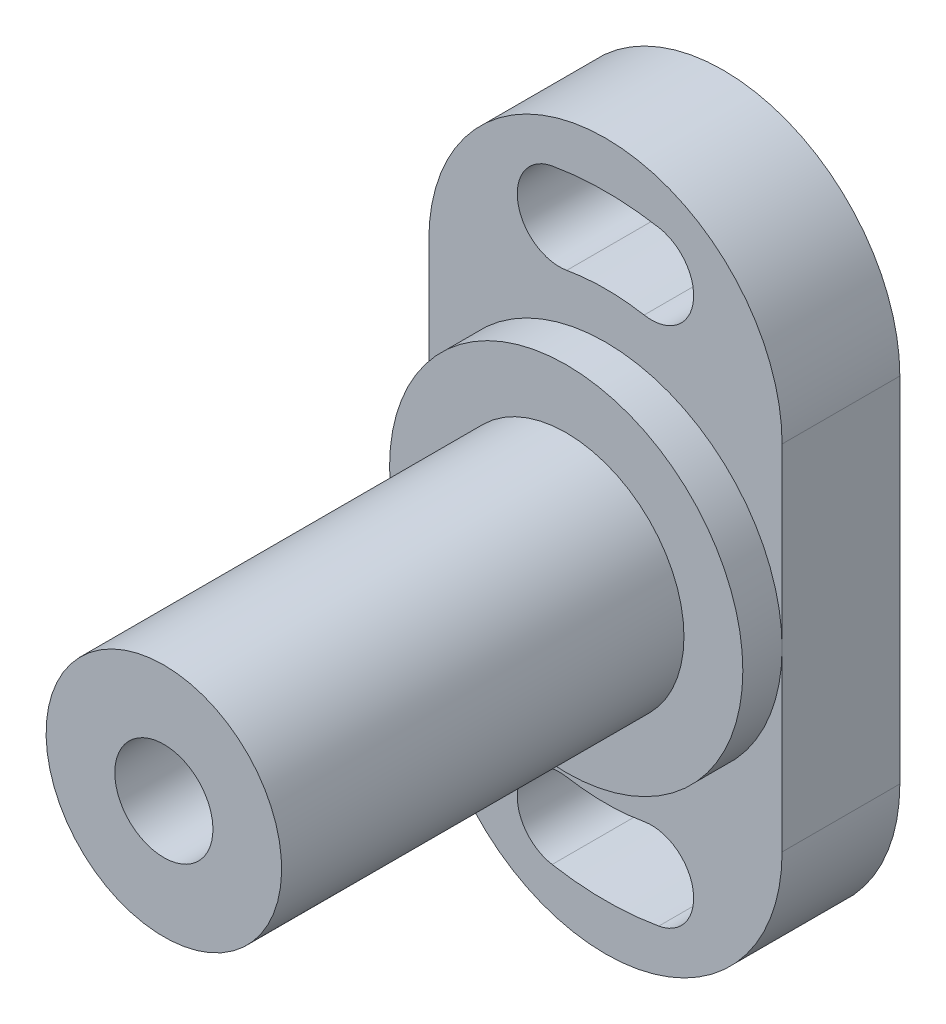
ISO-10303-21;
HEADER;
FILE_DESCRIPTION(('STEP AP214'),'2;1');
FILE_NAME('part.step','',(''),(''),'','','');
FILE_SCHEMA(('AUTOMOTIVE_DESIGN { 1 0 10303 214 1 1 1 1 }'));
ENDSEC;
DATA;
#1=APPLICATION_CONTEXT('core data for automotive mechanical design processes');
#2=APPLICATION_PROTOCOL_DEFINITION('international standard','automotive_design',2000,#1);
#3=PRODUCT_CONTEXT('',#1,'mechanical');
#4=PRODUCT('Part','Part','',(#3));
#5=PRODUCT_RELATED_PRODUCT_CATEGORY('part','',(#4));
#6=PRODUCT_DEFINITION_FORMATION('','',#4);
#7=PRODUCT_DEFINITION_CONTEXT('part definition',#1,'design');
#8=PRODUCT_DEFINITION('design','',#6,#7);
#9=PRODUCT_DEFINITION_SHAPE('','',#8);
#10=(LENGTH_UNIT() NAMED_UNIT(*) SI_UNIT(.MILLI.,.METRE.));
#11=(NAMED_UNIT(*) PLANE_ANGLE_UNIT() SI_UNIT($,.RADIAN.));
#12=(NAMED_UNIT(*) SI_UNIT($,.STERADIAN.) SOLID_ANGLE_UNIT());
#13=UNCERTAINTY_MEASURE_WITH_UNIT(LENGTH_MEASURE(1.E-05),#10,'distance_accuracy_value','');
#14=(GEOMETRIC_REPRESENTATION_CONTEXT(3) GLOBAL_UNCERTAINTY_ASSIGNED_CONTEXT((#13)) GLOBAL_UNIT_ASSIGNED_CONTEXT((#10,
#11,#12)) REPRESENTATION_CONTEXT('',''));
#15=CARTESIAN_POINT('',(0.,0.,0.));
#16=DIRECTION('',(0.,0.,1.));
#17=DIRECTION('',(1.,0.,0.));
#18=AXIS2_PLACEMENT_3D('',#15,#16,#17);
#19=CARTESIAN_POINT('',(0.,9.,6.));
#20=DIRECTION('',(0.,0.,1.));
#21=DIRECTION('',(0.,-1.,0.));
#22=AXIS2_PLACEMENT_3D('',#19,#20,#21);
#23=PLANE('',#22);
#24=CARTESIAN_POINT('',(0.,0.,6.));
#25=DIRECTION('',(0.,0.,-1.));
#26=DIRECTION('',(0.,1.,0.));
#27=AXIS2_PLACEMENT_3D('',#24,#25,#26);
#28=CIRCLE('',#27,9.);
#29=CARTESIAN_POINT('',(-9.,0.,6.));
#30=VERTEX_POINT('',#29);
#31=CARTESIAN_POINT('',(9.,0.,6.));
#32=VERTEX_POINT('',#31);
#33=EDGE_CURVE('E129',#30,#32,#28,.T.);
#34=ORIENTED_EDGE('',*,*,#33,.T.);
#35=DIRECTION('',(0.,1.,0.));
#36=VECTOR('',#35,1.);
#37=CARTESIAN_POINT('',(9.,9.,6.));
#38=LINE('',#37,#36);
#39=CARTESIAN_POINT('',(9.,9.,6.));
#40=VERTEX_POINT('',#39);
#41=EDGE_CURVE('E118',#32,#40,#38,.T.);
#42=ORIENTED_EDGE('',*,*,#41,.T.);
#43=CARTESIAN_POINT('',(0.,9.,6.));
#44=DIRECTION('',(0.,0.,1.));
#45=DIRECTION('',(0.,-1.,0.));
#46=AXIS2_PLACEMENT_3D('',#43,#44,#45);
#47=CIRCLE('',#46,9.);
#48=CARTESIAN_POINT('',(-9.,9.,6.));
#49=VERTEX_POINT('',#48);
#50=EDGE_CURVE('E213',#40,#49,#47,.T.);
#51=ORIENTED_EDGE('',*,*,#50,.T.);
#52=DIRECTION('',(0.,-1.,0.));
#53=VECTOR('',#52,1.);
#54=CARTESIAN_POINT('',(-9.,9.,6.));
#55=LINE('',#54,#53);
#56=EDGE_CURVE('E131',#49,#30,#55,.T.);
#57=ORIENTED_EDGE('',*,*,#56,.T.);
#58=EDGE_LOOP('',(#34,#42,#51,#57));
#59=FACE_BOUND('',#58,.T.);
#60=CARTESIAN_POINT('',(-2.34425039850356,13.2949046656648,6.));
#61=DIRECTION('',(0.,0.,1.));
#62=DIRECTION('',(0.,1.,0.));
#63=AXIS2_PLACEMENT_3D('',#60,#61,#62);
#64=CIRCLE('',#63,2.15);
#65=CARTESIAN_POINT('',(-2.71759398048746,15.412241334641,6.));
#66=VERTEX_POINT('',#65);
#67=CARTESIAN_POINT('',(-1.97090681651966,11.1775679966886,6.));
#68=VERTEX_POINT('',#67);
#69=EDGE_CURVE('E187',#66,#68,#64,.T.);
#70=ORIENTED_EDGE('',*,*,#69,.F.);
#71=CARTESIAN_POINT('',(0.,0.,6.));
#72=DIRECTION('',(0.,0.,1.));
#73=DIRECTION('',(0.,-1.,0.));
#74=AXIS2_PLACEMENT_3D('',#71,#72,#73);
#75=CIRCLE('',#74,15.65);
#76=CARTESIAN_POINT('',(2.71759398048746,15.412241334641,6.));
#77=VERTEX_POINT('',#76);
#78=EDGE_CURVE('E185',#77,#66,#75,.T.);
#79=ORIENTED_EDGE('',*,*,#78,.F.);
#80=CARTESIAN_POINT('',(2.34425039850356,13.2949046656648,6.));
#81=DIRECTION('',(0.,0.,1.));
#82=DIRECTION('',(0.,-1.,0.));
#83=AXIS2_PLACEMENT_3D('',#80,#81,#82);
#84=CIRCLE('',#83,2.15);
#85=CARTESIAN_POINT('',(1.97090681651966,11.1775679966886,6.));
#86=VERTEX_POINT('',#85);
#87=EDGE_CURVE('E192',#86,#77,#84,.T.);
#88=ORIENTED_EDGE('',*,*,#87,.F.);
#89=CARTESIAN_POINT('',(0.,0.,6.));
#90=DIRECTION('',(0.,0.,-1.));
#91=DIRECTION('',(0.,-1.,0.));
#92=AXIS2_PLACEMENT_3D('',#89,#90,#91);
#93=CIRCLE('',#92,11.35);
#94=EDGE_CURVE('E189',#68,#86,#93,.T.);
#95=ORIENTED_EDGE('',*,*,#94,.F.);
#96=EDGE_LOOP('',(#70,#79,#88,#95));
#97=FACE_BOUND('',#96,.T.);
#98=ADVANCED_FACE('F14',(#59,#97),#23,.T.);
#99=EDGE_CURVE('E30',#32,#30,#28,.T.);
#100=ORIENTED_EDGE('',*,*,#99,.T.);
#101=CARTESIAN_POINT('',(-9.,-9.,6.));
#102=VERTEX_POINT('',#101);
#103=EDGE_CURVE('E215',#30,#102,#55,.T.);
#104=ORIENTED_EDGE('',*,*,#103,.T.);
#105=CARTESIAN_POINT('',(0.,-9.,6.));
#106=DIRECTION('',(0.,0.,1.));
#107=DIRECTION('',(0.,1.,0.));
#108=AXIS2_PLACEMENT_3D('',#105,#106,#107);
#109=CIRCLE('',#108,9.);
#110=CARTESIAN_POINT('',(9.,-9.,6.));
#111=VERTEX_POINT('',#110);
#112=EDGE_CURVE('E113',#102,#111,#109,.T.);
#113=ORIENTED_EDGE('',*,*,#112,.T.);
#114=EDGE_CURVE('E108',#111,#32,#38,.T.);
#115=ORIENTED_EDGE('',*,*,#114,.T.);
#116=EDGE_LOOP('',(#100,#104,#113,#115));
#117=FACE_BOUND('',#116,.T.);
#118=CARTESIAN_POINT('',(0.,0.,6.));
#119=DIRECTION('',(0.,0.,-1.));
#120=DIRECTION('',(0.,1.,0.));
#121=AXIS2_PLACEMENT_3D('',#118,#119,#120);
#122=CIRCLE('',#121,11.35);
#123=CARTESIAN_POINT('',(1.97090681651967,-11.1775679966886,6.));
#124=VERTEX_POINT('',#123);
#125=CARTESIAN_POINT('',(-1.97090681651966,-11.1775679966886,6.));
#126=VERTEX_POINT('',#125);
#127=EDGE_CURVE('E158',#124,#126,#122,.T.);
#128=ORIENTED_EDGE('',*,*,#127,.F.);
#129=CARTESIAN_POINT('',(2.34425039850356,-13.2949046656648,6.));
#130=DIRECTION('',(0.,0.,1.));
#131=DIRECTION('',(0.,1.,0.));
#132=AXIS2_PLACEMENT_3D('',#129,#130,#131);
#133=CIRCLE('',#132,2.15);
#134=CARTESIAN_POINT('',(2.71759398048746,-15.412241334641,6.));
#135=VERTEX_POINT('',#134);
#136=EDGE_CURVE('E156',#135,#124,#133,.T.);
#137=ORIENTED_EDGE('',*,*,#136,.F.);
#138=CARTESIAN_POINT('',(0.,0.,6.));
#139=DIRECTION('',(0.,0.,1.));
#140=DIRECTION('',(0.,1.,0.));
#141=AXIS2_PLACEMENT_3D('',#138,#139,#140);
#142=CIRCLE('',#141,15.65);
#143=CARTESIAN_POINT('',(-2.71759398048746,-15.412241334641,6.));
#144=VERTEX_POINT('',#143);
#145=EDGE_CURVE('E162',#144,#135,#142,.T.);
#146=ORIENTED_EDGE('',*,*,#145,.F.);
#147=CARTESIAN_POINT('',(-2.34425039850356,-13.2949046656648,6.));
#148=DIRECTION('',(0.,0.,1.));
#149=DIRECTION('',(0.,-1.,0.));
#150=AXIS2_PLACEMENT_3D('',#147,#148,#149);
#151=CIRCLE('',#150,2.15);
#152=EDGE_CURVE('E160',#126,#144,#151,.T.);
#153=ORIENTED_EDGE('',*,*,#152,.F.);
#154=EDGE_LOOP('',(#128,#137,#146,#153));
#155=FACE_BOUND('',#154,.T.);
#156=ADVANCED_FACE('F110',(#117,#155),#23,.T.);
#157=CARTESIAN_POINT('',(0.,9.,0.));
#158=DIRECTION('',(0.,0.,1.));
#159=DIRECTION('',(0.,-1.,0.));
#160=AXIS2_PLACEMENT_3D('',#157,#158,#159);
#161=PLANE('',#160);
#162=CARTESIAN_POINT('',(0.,0.,0.));
#163=DIRECTION('',(0.,0.,1.));
#164=DIRECTION('',(0.,-1.,0.));
#165=AXIS2_PLACEMENT_3D('',#162,#163,#164);
#166=CIRCLE('',#165,15.65);
#167=CARTESIAN_POINT('',(2.71759398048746,15.412241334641,0.));
#168=VERTEX_POINT('',#167);
#169=CARTESIAN_POINT('',(-2.71759398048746,15.412241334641,0.));
#170=VERTEX_POINT('',#169);
#171=EDGE_CURVE('E173',#168,#170,#166,.T.);
#172=ORIENTED_EDGE('',*,*,#171,.T.);
#173=CARTESIAN_POINT('',(-2.34425039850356,13.2949046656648,0.));
#174=DIRECTION('',(0.,0.,1.));
#175=DIRECTION('',(0.,1.,0.));
#176=AXIS2_PLACEMENT_3D('',#173,#174,#175);
#177=CIRCLE('',#176,2.15);
#178=CARTESIAN_POINT('',(-1.97090681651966,11.1775679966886,0.));
#179=VERTEX_POINT('',#178);
#180=EDGE_CURVE('E176',#170,#179,#177,.T.);
#181=ORIENTED_EDGE('',*,*,#180,.T.);
#182=CARTESIAN_POINT('',(0.,0.,0.));
#183=DIRECTION('',(0.,0.,-1.));
#184=DIRECTION('',(0.,-1.,0.));
#185=AXIS2_PLACEMENT_3D('',#182,#183,#184);
#186=CIRCLE('',#185,11.35);
#187=CARTESIAN_POINT('',(1.97090681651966,11.1775679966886,0.));
#188=VERTEX_POINT('',#187);
#189=EDGE_CURVE('E179',#179,#188,#186,.T.);
#190=ORIENTED_EDGE('',*,*,#189,.T.);
#191=CARTESIAN_POINT('',(2.34425039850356,13.2949046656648,0.));
#192=DIRECTION('',(0.,0.,1.));
#193=DIRECTION('',(0.,-1.,0.));
#194=AXIS2_PLACEMENT_3D('',#191,#192,#193);
#195=CIRCLE('',#194,2.15);
#196=EDGE_CURVE('E182',#188,#168,#195,.T.);
#197=ORIENTED_EDGE('',*,*,#196,.T.);
#198=EDGE_LOOP('',(#172,#181,#190,#197));
#199=FACE_BOUND('',#198,.T.);
#200=CARTESIAN_POINT('',(0.,9.,0.));
#201=DIRECTION('',(0.,0.,1.));
#202=DIRECTION('',(0.,-1.,0.));
#203=AXIS2_PLACEMENT_3D('',#200,#201,#202);
#204=CIRCLE('',#203,9.);
#205=CARTESIAN_POINT('',(9.,9.,0.));
#206=VERTEX_POINT('',#205);
#207=CARTESIAN_POINT('',(-9.,9.,0.));
#208=VERTEX_POINT('',#207);
#209=EDGE_CURVE('E204',#206,#208,#204,.T.);
#210=ORIENTED_EDGE('',*,*,#209,.F.);
#211=DIRECTION('',(0.,1.,0.));
#212=VECTOR('',#211,1.);
#213=CARTESIAN_POINT('',(9.,9.,0.));
#214=LINE('',#213,#212);
#215=CARTESIAN_POINT('',(9.,-9.,0.));
#216=VERTEX_POINT('',#215);
#217=EDGE_CURVE('E211',#216,#206,#214,.T.);
#218=ORIENTED_EDGE('',*,*,#217,.F.);
#219=CARTESIAN_POINT('',(0.,-9.,0.));
#220=DIRECTION('',(0.,0.,1.));
#221=DIRECTION('',(0.,1.,0.));
#222=AXIS2_PLACEMENT_3D('',#219,#220,#221);
#223=CIRCLE('',#222,9.);
#224=CARTESIAN_POINT('',(-9.,-9.,0.));
#225=VERTEX_POINT('',#224);
#226=EDGE_CURVE('E209',#225,#216,#223,.T.);
#227=ORIENTED_EDGE('',*,*,#226,.F.);
#228=DIRECTION('',(0.,-1.,0.));
#229=VECTOR('',#228,1.);
#230=CARTESIAN_POINT('',(-9.,9.,0.));
#231=LINE('',#230,#229);
#232=EDGE_CURVE('E207',#208,#225,#231,.T.);
#233=ORIENTED_EDGE('',*,*,#232,.F.);
#234=EDGE_LOOP('',(#210,#218,#227,#233));
#235=FACE_BOUND('',#234,.T.);
#236=CARTESIAN_POINT('',(2.34425039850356,-13.2949046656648,0.));
#237=DIRECTION('',(0.,0.,1.));
#238=DIRECTION('',(0.,1.,0.));
#239=AXIS2_PLACEMENT_3D('',#236,#237,#238);
#240=CIRCLE('',#239,2.15);
#241=CARTESIAN_POINT('',(2.71759398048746,-15.412241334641,0.));
#242=VERTEX_POINT('',#241);
#243=CARTESIAN_POINT('',(1.97090681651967,-11.1775679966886,0.));
#244=VERTEX_POINT('',#243);
#245=EDGE_CURVE('E144',#242,#244,#240,.T.);
#246=ORIENTED_EDGE('',*,*,#245,.T.);
#247=CARTESIAN_POINT('',(0.,0.,0.));
#248=DIRECTION('',(0.,0.,-1.));
#249=DIRECTION('',(0.,1.,0.));
#250=AXIS2_PLACEMENT_3D('',#247,#248,#249);
#251=CIRCLE('',#250,11.35);
#252=CARTESIAN_POINT('',(-1.97090681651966,-11.1775679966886,0.));
#253=VERTEX_POINT('',#252);
#254=EDGE_CURVE('E147',#244,#253,#251,.T.);
#255=ORIENTED_EDGE('',*,*,#254,.T.);
#256=CARTESIAN_POINT('',(-2.34425039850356,-13.2949046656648,0.));
#257=DIRECTION('',(0.,0.,1.));
#258=DIRECTION('',(0.,-1.,0.));
#259=AXIS2_PLACEMENT_3D('',#256,#257,#258);
#260=CIRCLE('',#259,2.15);
#261=CARTESIAN_POINT('',(-2.71759398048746,-15.412241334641,0.));
#262=VERTEX_POINT('',#261);
#263=EDGE_CURVE('E150',#253,#262,#260,.T.);
#264=ORIENTED_EDGE('',*,*,#263,.T.);
#265=CARTESIAN_POINT('',(0.,0.,0.));
#266=DIRECTION('',(0.,0.,1.));
#267=DIRECTION('',(0.,1.,0.));
#268=AXIS2_PLACEMENT_3D('',#265,#266,#267);
#269=CIRCLE('',#268,15.65);
#270=EDGE_CURVE('E153',#262,#242,#269,.T.);
#271=ORIENTED_EDGE('',*,*,#270,.T.);
#272=EDGE_LOOP('',(#246,#255,#264,#271));
#273=FACE_BOUND('',#272,.T.);
#274=ADVANCED_FACE('F233',(#199,#235,#273),#161,.F.);
#275=CARTESIAN_POINT('',(0.,9.,6.));
#276=DIRECTION('',(0.,0.,-1.));
#277=DIRECTION('',(0.,1.,0.));
#278=AXIS2_PLACEMENT_3D('',#275,#276,#277);
#279=CYLINDRICAL_SURFACE('',#278,9.);
#280=ORIENTED_EDGE('',*,*,#209,.T.);
#281=DIRECTION('',(0.,0.,-1.));
#282=VECTOR('',#281,1.);
#283=CARTESIAN_POINT('',(-9.,9.,6.));
#284=LINE('',#283,#282);
#285=EDGE_CURVE('E23',#49,#208,#284,.T.);
#286=ORIENTED_EDGE('',*,*,#285,.F.);
#287=ORIENTED_EDGE('',*,*,#50,.F.);
#288=DIRECTION('',(0.,0.,-1.));
#289=VECTOR('',#288,1.);
#290=CARTESIAN_POINT('',(9.,9.,6.));
#291=LINE('',#290,#289);
#292=EDGE_CURVE('E117',#40,#206,#291,.T.);
#293=ORIENTED_EDGE('',*,*,#292,.T.);
#294=EDGE_LOOP('',(#280,#286,#287,#293));
#295=FACE_BOUND('',#294,.T.);
#296=ADVANCED_FACE('F16',(#295),#279,.T.);
#297=CARTESIAN_POINT('',(-9.,9.,6.));
#298=DIRECTION('',(1.,0.,0.));
#299=DIRECTION('',(0.,1.,0.));
#300=AXIS2_PLACEMENT_3D('',#297,#298,#299);
#301=PLANE('',#300);
#302=ORIENTED_EDGE('',*,*,#232,.T.);
#303=DIRECTION('',(0.,0.,-1.));
#304=VECTOR('',#303,1.);
#305=CARTESIAN_POINT('',(-9.,-9.,6.));
#306=LINE('',#305,#304);
#307=EDGE_CURVE('E221',#102,#225,#306,.T.);
#308=ORIENTED_EDGE('',*,*,#307,.F.);
#309=ORIENTED_EDGE('',*,*,#103,.F.);
#310=ORIENTED_EDGE('',*,*,#56,.F.);
#311=ORIENTED_EDGE('',*,*,#285,.T.);
#312=EDGE_LOOP('',(#302,#308,#309,#310,#311));
#313=FACE_BOUND('',#312,.T.);
#314=ADVANCED_FACE('F227',(#313),#301,.F.);
#315=CARTESIAN_POINT('',(0.,-9.,6.));
#316=DIRECTION('',(0.,0.,-1.));
#317=DIRECTION('',(0.,1.,0.));
#318=AXIS2_PLACEMENT_3D('',#315,#316,#317);
#319=CYLINDRICAL_SURFACE('',#318,9.);
#320=ORIENTED_EDGE('',*,*,#226,.T.);
#321=DIRECTION('',(0.,0.,-1.));
#322=VECTOR('',#321,1.);
#323=CARTESIAN_POINT('',(9.,-9.,6.));
#324=LINE('',#323,#322);
#325=EDGE_CURVE('E219',#111,#216,#324,.T.);
#326=ORIENTED_EDGE('',*,*,#325,.F.);
#327=ORIENTED_EDGE('',*,*,#112,.F.);
#328=ORIENTED_EDGE('',*,*,#307,.T.);
#329=EDGE_LOOP('',(#320,#326,#327,#328));
#330=FACE_BOUND('',#329,.T.);
#331=ADVANCED_FACE('F237',(#330),#319,.T.);
#332=CARTESIAN_POINT('',(9.,9.,6.));
#333=DIRECTION('',(-1.,0.,0.));
#334=DIRECTION('',(0.,-1.,0.));
#335=AXIS2_PLACEMENT_3D('',#332,#333,#334);
#336=PLANE('',#335);
#337=ORIENTED_EDGE('',*,*,#217,.T.);
#338=ORIENTED_EDGE('',*,*,#292,.F.);
#339=ORIENTED_EDGE('',*,*,#41,.F.);
#340=ORIENTED_EDGE('',*,*,#114,.F.);
#341=ORIENTED_EDGE('',*,*,#325,.T.);
#342=EDGE_LOOP('',(#337,#338,#339,#340,#341));
#343=FACE_BOUND('',#342,.T.);
#344=ADVANCED_FACE('F122',(#343),#336,.F.);
#345=CARTESIAN_POINT('',(0.,0.,6.));
#346=DIRECTION('',(0.,0.,-1.));
#347=DIRECTION('',(0.,1.,0.));
#348=AXIS2_PLACEMENT_3D('',#345,#346,#347);
#349=CYLINDRICAL_SURFACE('',#348,15.65);
#350=ORIENTED_EDGE('',*,*,#171,.F.);
#351=DIRECTION('',(0.,0.,-1.));
#352=VECTOR('',#351,1.);
#353=CARTESIAN_POINT('',(2.71759398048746,15.412241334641,6.));
#354=LINE('',#353,#352);
#355=EDGE_CURVE('E194',#77,#168,#354,.T.);
#356=ORIENTED_EDGE('',*,*,#355,.F.);
#357=ORIENTED_EDGE('',*,*,#78,.T.);
#358=DIRECTION('',(0.,0.,-1.));
#359=VECTOR('',#358,1.);
#360=CARTESIAN_POINT('',(-2.71759398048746,15.412241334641,6.));
#361=LINE('',#360,#359);
#362=EDGE_CURVE('E201',#66,#170,#361,.T.);
#363=ORIENTED_EDGE('',*,*,#362,.T.);
#364=EDGE_LOOP('',(#350,#356,#357,#363));
#365=FACE_BOUND('',#364,.T.);
#366=ADVANCED_FACE('F245',(#365),#349,.F.);
#367=CARTESIAN_POINT('',(-2.34425039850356,13.2949046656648,6.));
#368=DIRECTION('',(0.,0.,-1.));
#369=DIRECTION('',(0.,1.,0.));
#370=AXIS2_PLACEMENT_3D('',#367,#368,#369);
#371=CYLINDRICAL_SURFACE('',#370,2.15);
#372=ORIENTED_EDGE('',*,*,#180,.F.);
#373=ORIENTED_EDGE('',*,*,#362,.F.);
#374=ORIENTED_EDGE('',*,*,#69,.T.);
#375=DIRECTION('',(0.,0.,-1.));
#376=VECTOR('',#375,1.);
#377=CARTESIAN_POINT('',(-1.97090681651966,11.1775679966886,6.));
#378=LINE('',#377,#376);
#379=EDGE_CURVE('E199',#68,#179,#378,.T.);
#380=ORIENTED_EDGE('',*,*,#379,.T.);
#381=EDGE_LOOP('',(#372,#373,#374,#380));
#382=FACE_BOUND('',#381,.T.);
#383=ADVANCED_FACE('F258',(#382),#371,.F.);
#384=CARTESIAN_POINT('',(0.,0.,6.));
#385=DIRECTION('',(0.,0.,-1.));
#386=DIRECTION('',(0.,1.,0.));
#387=AXIS2_PLACEMENT_3D('',#384,#385,#386);
#388=CYLINDRICAL_SURFACE('',#387,11.35);
#389=ORIENTED_EDGE('',*,*,#189,.F.);
#390=ORIENTED_EDGE('',*,*,#379,.F.);
#391=ORIENTED_EDGE('',*,*,#94,.T.);
#392=DIRECTION('',(0.,0.,-1.));
#393=VECTOR('',#392,1.);
#394=CARTESIAN_POINT('',(1.97090681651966,11.1775679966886,6.));
#395=LINE('',#394,#393);
#396=EDGE_CURVE('E197',#86,#188,#395,.T.);
#397=ORIENTED_EDGE('',*,*,#396,.T.);
#398=EDGE_LOOP('',(#389,#390,#391,#397));
#399=FACE_BOUND('',#398,.T.);
#400=ADVANCED_FACE('F262',(#399),#388,.T.);
#401=CARTESIAN_POINT('',(2.34425039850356,13.2949046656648,6.));
#402=DIRECTION('',(0.,0.,-1.));
#403=DIRECTION('',(0.,1.,0.));
#404=AXIS2_PLACEMENT_3D('',#401,#402,#403);
#405=CYLINDRICAL_SURFACE('',#404,2.15);
#406=ORIENTED_EDGE('',*,*,#196,.F.);
#407=ORIENTED_EDGE('',*,*,#396,.F.);
#408=ORIENTED_EDGE('',*,*,#87,.T.);
#409=ORIENTED_EDGE('',*,*,#355,.T.);
#410=EDGE_LOOP('',(#406,#407,#408,#409));
#411=FACE_BOUND('',#410,.T.);
#412=ADVANCED_FACE('F266',(#411),#405,.F.);
#413=CARTESIAN_POINT('',(2.34425039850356,-13.2949046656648,6.));
#414=DIRECTION('',(0.,0.,-1.));
#415=DIRECTION('',(0.,1.,0.));
#416=AXIS2_PLACEMENT_3D('',#413,#414,#415);
#417=CYLINDRICAL_SURFACE('',#416,2.15);
#418=ORIENTED_EDGE('',*,*,#245,.F.);
#419=DIRECTION('',(0.,0.,-1.));
#420=VECTOR('',#419,1.);
#421=CARTESIAN_POINT('',(2.71759398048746,-15.412241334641,6.));
#422=LINE('',#421,#420);
#423=EDGE_CURVE('E164',#135,#242,#422,.T.);
#424=ORIENTED_EDGE('',*,*,#423,.F.);
#425=ORIENTED_EDGE('',*,*,#136,.T.);
#426=DIRECTION('',(0.,0.,-1.));
#427=VECTOR('',#426,1.);
#428=CARTESIAN_POINT('',(1.97090681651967,-11.1775679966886,6.));
#429=LINE('',#428,#427);
#430=EDGE_CURVE('E170',#124,#244,#429,.T.);
#431=ORIENTED_EDGE('',*,*,#430,.T.);
#432=EDGE_LOOP('',(#418,#424,#425,#431));
#433=FACE_BOUND('',#432,.T.);
#434=ADVANCED_FACE('F270',(#433),#417,.F.);
#435=CARTESIAN_POINT('',(0.,0.,6.));
#436=DIRECTION('',(0.,0.,-1.));
#437=DIRECTION('',(0.,1.,0.));
#438=AXIS2_PLACEMENT_3D('',#435,#436,#437);
#439=CYLINDRICAL_SURFACE('',#438,11.35);
#440=ORIENTED_EDGE('',*,*,#254,.F.);
#441=ORIENTED_EDGE('',*,*,#430,.F.);
#442=ORIENTED_EDGE('',*,*,#127,.T.);
#443=DIRECTION('',(0.,0.,-1.));
#444=VECTOR('',#443,1.);
#445=CARTESIAN_POINT('',(-1.97090681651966,-11.1775679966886,6.));
#446=LINE('',#445,#444);
#447=EDGE_CURVE('E168',#126,#253,#446,.T.);
#448=ORIENTED_EDGE('',*,*,#447,.T.);
#449=EDGE_LOOP('',(#440,#441,#442,#448));
#450=FACE_BOUND('',#449,.T.);
#451=ADVANCED_FACE('F274',(#450),#439,.T.);
#452=CARTESIAN_POINT('',(-2.34425039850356,-13.2949046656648,6.));
#453=DIRECTION('',(0.,0.,-1.));
#454=DIRECTION('',(0.,1.,0.));
#455=AXIS2_PLACEMENT_3D('',#452,#453,#454);
#456=CYLINDRICAL_SURFACE('',#455,2.15);
#457=ORIENTED_EDGE('',*,*,#263,.F.);
#458=ORIENTED_EDGE('',*,*,#447,.F.);
#459=ORIENTED_EDGE('',*,*,#152,.T.);
#460=DIRECTION('',(0.,0.,-1.));
#461=VECTOR('',#460,1.);
#462=CARTESIAN_POINT('',(-2.71759398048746,-15.412241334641,6.));
#463=LINE('',#462,#461);
#464=EDGE_CURVE('E38',#144,#262,#463,.T.);
#465=ORIENTED_EDGE('',*,*,#464,.T.);
#466=EDGE_LOOP('',(#457,#458,#459,#465));
#467=FACE_BOUND('',#466,.T.);
#468=ADVANCED_FACE('F278',(#467),#456,.F.);
#469=CARTESIAN_POINT('',(0.,0.,6.));
#470=DIRECTION('',(0.,0.,-1.));
#471=DIRECTION('',(0.,1.,0.));
#472=AXIS2_PLACEMENT_3D('',#469,#470,#471);
#473=CYLINDRICAL_SURFACE('',#472,15.65);
#474=ORIENTED_EDGE('',*,*,#270,.F.);
#475=ORIENTED_EDGE('',*,*,#464,.F.);
#476=ORIENTED_EDGE('',*,*,#145,.T.);
#477=ORIENTED_EDGE('',*,*,#423,.T.);
#478=EDGE_LOOP('',(#474,#475,#476,#477));
#479=FACE_BOUND('',#478,.T.);
#480=ADVANCED_FACE('F282',(#479),#473,.F.);
#481=CARTESIAN_POINT('',(6.,0.,8.));
#482=DIRECTION('',(0.,0.,1.));
#483=DIRECTION('',(0.,-1.,0.));
#484=AXIS2_PLACEMENT_3D('',#481,#482,#483);
#485=PLANE('',#484);
#486=CARTESIAN_POINT('',(0.,0.,8.));
#487=DIRECTION('',(0.,0.,1.));
#488=DIRECTION('',(0.,-1.,0.));
#489=AXIS2_PLACEMENT_3D('',#486,#487,#488);
#490=CIRCLE('',#489,6.);
#491=CARTESIAN_POINT('',(0.,-6.,8.));
#492=VERTEX_POINT('',#491);
#493=EDGE_CURVE('E9',#492,#492,#490,.F.);
#494=ORIENTED_EDGE('',*,*,#493,.T.);
#495=EDGE_LOOP('',(#494));
#496=FACE_BOUND('',#495,.T.);
#497=CARTESIAN_POINT('',(0.,0.,8.));
#498=DIRECTION('',(0.,0.,-1.));
#499=DIRECTION('',(0.,1.,0.));
#500=AXIS2_PLACEMENT_3D('',#497,#498,#499);
#501=CIRCLE('',#500,9.);
#502=CARTESIAN_POINT('',(0.,9.,8.));
#503=VERTEX_POINT('',#502);
#504=EDGE_CURVE('E135',#503,#503,#501,.T.);
#505=ORIENTED_EDGE('',*,*,#504,.F.);
#506=EDGE_LOOP('',(#505));
#507=FACE_BOUND('',#506,.T.);
#508=ADVANCED_FACE('F286',(#496,#507),#485,.T.);
#509=CARTESIAN_POINT('',(0.,0.,0.));
#510=DIRECTION('',(0.,0.,-1.));
#511=DIRECTION('',(0.,1.,0.));
#512=AXIS2_PLACEMENT_3D('',#509,#510,#511);
#513=CYLINDRICAL_SURFACE('',#512,9.);
#514=ORIENTED_EDGE('',*,*,#504,.T.);
#515=EDGE_LOOP('',(#514));
#516=FACE_BOUND('',#515,.T.);
#517=ORIENTED_EDGE('',*,*,#99,.F.);
#518=ORIENTED_EDGE('',*,*,#33,.F.);
#519=EDGE_LOOP('',(#517,#518));
#520=FACE_BOUND('',#519,.T.);
#521=ADVANCED_FACE('F134',(#516,#520),#513,.T.);
#522=CARTESIAN_POINT('',(6.,0.,28.5));
#523=DIRECTION('',(0.,0.,1.));
#524=DIRECTION('',(0.,-1.,0.));
#525=AXIS2_PLACEMENT_3D('',#522,#523,#524);
#526=PLANE('',#525);
#527=CARTESIAN_POINT('',(0.,0.,28.5));
#528=DIRECTION('',(0.,0.,1.));
#529=DIRECTION('',(0.,-1.,0.));
#530=AXIS2_PLACEMENT_3D('',#527,#528,#529);
#531=CIRCLE('',#530,2.5);
#532=CARTESIAN_POINT('',(0.,-2.5,28.5));
#533=VERTEX_POINT('',#532);
#534=EDGE_CURVE('E18',#533,#533,#531,.T.);
#535=ORIENTED_EDGE('',*,*,#534,.F.);
#536=EDGE_LOOP('',(#535));
#537=FACE_BOUND('',#536,.T.);
#538=CARTESIAN_POINT('',(0.,0.,28.5));
#539=DIRECTION('',(0.,0.,-1.));
#540=DIRECTION('',(0.,1.,0.));
#541=AXIS2_PLACEMENT_3D('',#538,#539,#540);
#542=CIRCLE('',#541,6.);
#543=CARTESIAN_POINT('',(0.,6.,28.5));
#544=VERTEX_POINT('',#543);
#545=EDGE_CURVE('E137',#544,#544,#542,.T.);
#546=ORIENTED_EDGE('',*,*,#545,.F.);
#547=EDGE_LOOP('',(#546));
#548=FACE_BOUND('',#547,.T.);
#549=ADVANCED_FACE('F287',(#537,#548),#526,.T.);
#550=CARTESIAN_POINT('',(0.,0.,0.));
#551=DIRECTION('',(0.,0.,-1.));
#552=DIRECTION('',(0.,1.,0.));
#553=AXIS2_PLACEMENT_3D('',#550,#551,#552);
#554=CYLINDRICAL_SURFACE('',#553,6.);
#555=ORIENTED_EDGE('',*,*,#493,.F.);
#556=EDGE_LOOP('',(#555));
#557=FACE_BOUND('',#556,.T.);
#558=ORIENTED_EDGE('',*,*,#545,.T.);
#559=EDGE_LOOP('',(#558));
#560=FACE_BOUND('',#559,.T.);
#561=ADVANCED_FACE('F290',(#557,#560),#554,.T.);
#562=CARTESIAN_POINT('',(0.,0.,42.));
#563=DIRECTION('',(0.,0.,-1.));
#564=DIRECTION('',(0.5,-0.866025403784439,0.));
#565=AXIS2_PLACEMENT_3D('',#562,#563,#564);
#566=CYLINDRICAL_SURFACE('',#565,2.5);
#567=ORIENTED_EDGE('',*,*,#534,.T.);
#568=EDGE_LOOP('',(#567));
#569=FACE_BOUND('',#568,.T.);
#570=CARTESIAN_POINT('',(0.,0.,7.));
#571=DIRECTION('',(0.,0.,-1.));
#572=DIRECTION('',(0.,1.,0.));
#573=AXIS2_PLACEMENT_3D('',#570,#571,#572);
#574=CIRCLE('',#573,2.5);
#575=CARTESIAN_POINT('',(0.,2.5,7.));
#576=VERTEX_POINT('',#575);
#577=EDGE_CURVE('E140',#576,#576,#574,.F.);
#578=ORIENTED_EDGE('',*,*,#577,.F.);
#579=EDGE_LOOP('',(#578));
#580=FACE_BOUND('',#579,.T.);
#581=ADVANCED_FACE('F294',(#569,#580),#566,.F.);
#582=CARTESIAN_POINT('',(0.,0.,7.));
#583=DIRECTION('',(0.,0.,-1.));
#584=DIRECTION('',(0.,1.,0.));
#585=AXIS2_PLACEMENT_3D('',#582,#583,#584);
#586=PLANE('',#585);
#587=ORIENTED_EDGE('',*,*,#577,.T.);
#588=EDGE_LOOP('',(#587));
#589=FACE_BOUND('',#588,.T.);
#590=ADVANCED_FACE('F304',(#589),#586,.F.);
#591=CLOSED_SHELL('',(#98,#156,#274,#296,#314,#331,#344,#366,#383,#400,#412,#434,#451,#468,#480,
#508,#521,#549,#561,#581,#590));
#592=MANIFOLD_SOLID_BREP('B1',#591);
#593=ADVANCED_BREP_SHAPE_REPRESENTATION('',(#18,#592),#14);
#594=SHAPE_DEFINITION_REPRESENTATION(#9,#593);
ENDSEC;
END-ISO-10303-21;
